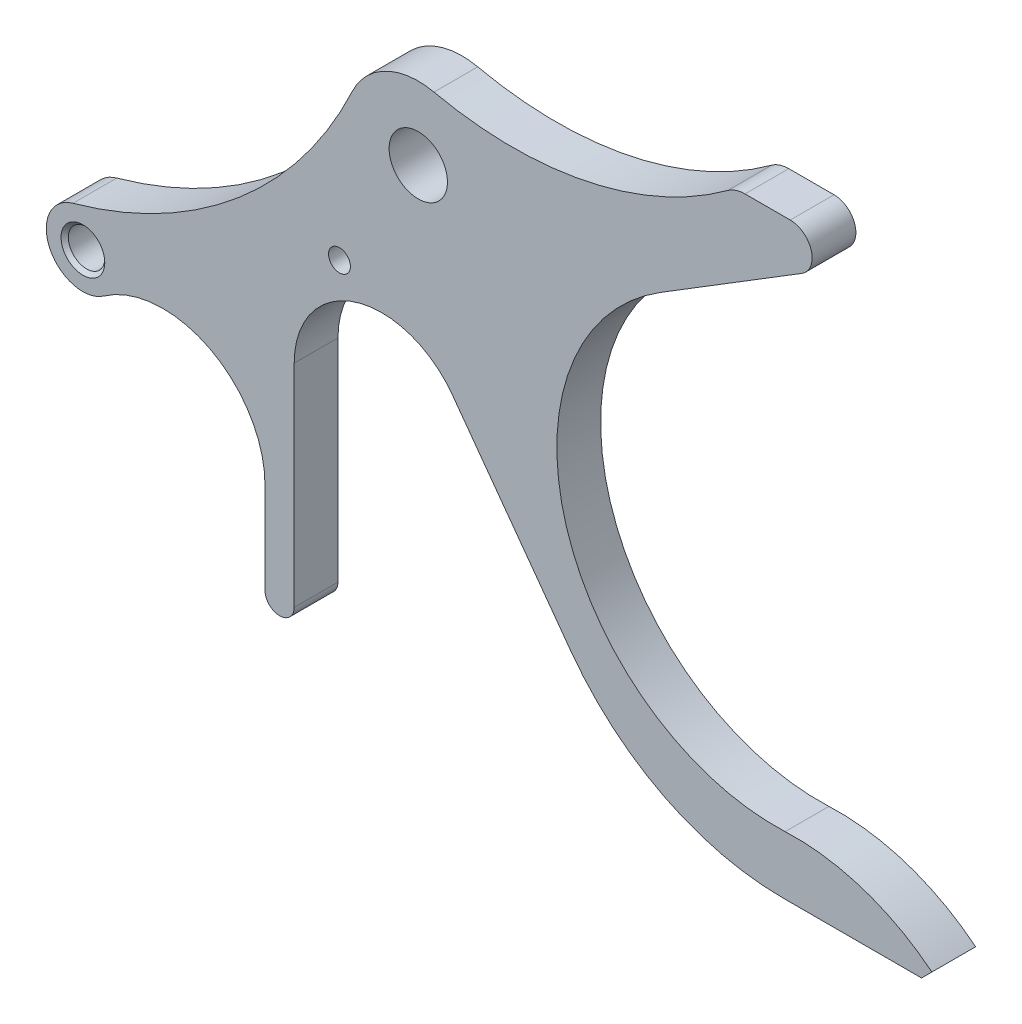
ISO-10303-21;
HEADER;
FILE_DESCRIPTION(('STEP AP214'),'2;1');
FILE_NAME('part.step','',(''),(''),'','','');
FILE_SCHEMA(('AUTOMOTIVE_DESIGN { 1 0 10303 214 1 1 1 1 }'));
ENDSEC;
DATA;
#1=APPLICATION_CONTEXT('core data for automotive mechanical design processes');
#2=APPLICATION_PROTOCOL_DEFINITION('international standard','automotive_design',2000,#1);
#3=PRODUCT_CONTEXT('',#1,'mechanical');
#4=PRODUCT('Part','Part','',(#3));
#5=PRODUCT_RELATED_PRODUCT_CATEGORY('part','',(#4));
#6=PRODUCT_DEFINITION_FORMATION('','',#4);
#7=PRODUCT_DEFINITION_CONTEXT('part definition',#1,'design');
#8=PRODUCT_DEFINITION('design','',#6,#7);
#9=PRODUCT_DEFINITION_SHAPE('','',#8);
#10=(LENGTH_UNIT() NAMED_UNIT(*) SI_UNIT(.MILLI.,.METRE.));
#11=(NAMED_UNIT(*) PLANE_ANGLE_UNIT() SI_UNIT($,.RADIAN.));
#12=(NAMED_UNIT(*) SI_UNIT($,.STERADIAN.) SOLID_ANGLE_UNIT());
#13=UNCERTAINTY_MEASURE_WITH_UNIT(LENGTH_MEASURE(1.E-05),#10,'distance_accuracy_value','');
#14=(GEOMETRIC_REPRESENTATION_CONTEXT(3) GLOBAL_UNCERTAINTY_ASSIGNED_CONTEXT((#13)) GLOBAL_UNIT_ASSIGNED_CONTEXT((#10,
#11,#12)) REPRESENTATION_CONTEXT('',''));
#15=CARTESIAN_POINT('',(0.,0.,0.));
#16=DIRECTION('',(0.,0.,1.));
#17=DIRECTION('',(1.,0.,0.));
#18=AXIS2_PLACEMENT_3D('',#15,#16,#17);
#19=CARTESIAN_POINT('',(-17.505684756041,-24.25,3.));
#20=DIRECTION('',(0.,0.,-1.));
#21=DIRECTION('',(-1.,0.,0.));
#22=AXIS2_PLACEMENT_3D('',#19,#20,#21);
#23=CYLINDRICAL_SURFACE('',#22,7.);
#24=CARTESIAN_POINT('',(-17.505684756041,-24.25,0.));
#25=DIRECTION('',(0.,0.,-1.));
#26=DIRECTION('',(1.,0.,0.));
#27=AXIS2_PLACEMENT_3D('',#24,#25,#26);
#28=CIRCLE('',#27,7.);
#29=CARTESIAN_POINT('',(-21.5541275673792,-18.5394736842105,0.));
#30=VERTEX_POINT('',#29);
#31=CARTESIAN_POINT('',(-10.505684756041,-24.25,0.));
#32=VERTEX_POINT('',#31);
#33=EDGE_CURVE('E163',#30,#32,#28,.T.);
#34=ORIENTED_EDGE('',*,*,#33,.T.);
#35=DIRECTION('',(0.,0.,-1.));
#36=VECTOR('',#35,1.);
#37=CARTESIAN_POINT('',(-10.505684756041,-24.25,3.));
#38=LINE('',#37,#36);
#39=CARTESIAN_POINT('',(-10.505684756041,-24.25,3.));
#40=VERTEX_POINT('',#39);
#41=EDGE_CURVE('E11',#40,#32,#38,.T.);
#42=ORIENTED_EDGE('',*,*,#41,.F.);
#43=CARTESIAN_POINT('',(-17.505684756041,-24.25,3.));
#44=DIRECTION('',(0.,0.,-1.));
#45=DIRECTION('',(1.,0.,0.));
#46=AXIS2_PLACEMENT_3D('',#43,#44,#45);
#47=CIRCLE('',#46,7.);
#48=CARTESIAN_POINT('',(-21.5541275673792,-18.5394736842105,3.));
#49=VERTEX_POINT('',#48);
#50=EDGE_CURVE('E217',#49,#40,#47,.T.);
#51=ORIENTED_EDGE('',*,*,#50,.F.);
#52=DIRECTION('',(0.,0.,-1.));
#53=VECTOR('',#52,1.);
#54=CARTESIAN_POINT('',(-21.5541275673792,-18.5394736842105,3.));
#55=LINE('',#54,#53);
#56=EDGE_CURVE('E176',#49,#30,#55,.T.);
#57=ORIENTED_EDGE('',*,*,#56,.T.);
#58=EDGE_LOOP('',(#34,#42,#51,#57));
#59=FACE_BOUND('',#58,.T.);
#60=ADVANCED_FACE('F27',(#59),#23,.F.);
#61=CARTESIAN_POINT('',(-10.505684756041,-24.25,3.));
#62=DIRECTION('',(1.,0.,0.));
#63=DIRECTION('',(0.,1.,0.));
#64=AXIS2_PLACEMENT_3D('',#61,#62,#63);
#65=PLANE('',#64);
#66=DIRECTION('',(0.,-1.,0.));
#67=VECTOR('',#66,1.);
#68=CARTESIAN_POINT('',(-10.505684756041,-24.25,0.));
#69=LINE('',#68,#67);
#70=CARTESIAN_POINT('',(-10.505684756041,-30.5,0.));
#71=VERTEX_POINT('',#70);
#72=EDGE_CURVE('E159',#32,#71,#69,.T.);
#73=ORIENTED_EDGE('',*,*,#72,.T.);
#74=DIRECTION('',(0.,0.,-1.));
#75=VECTOR('',#74,1.);
#76=CARTESIAN_POINT('',(-10.505684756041,-30.5,3.));
#77=LINE('',#76,#75);
#78=CARTESIAN_POINT('',(-10.505684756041,-30.5,3.));
#79=VERTEX_POINT('',#78);
#80=EDGE_CURVE('E35',#79,#71,#77,.T.);
#81=ORIENTED_EDGE('',*,*,#80,.F.);
#82=DIRECTION('',(0.,-1.,0.));
#83=VECTOR('',#82,1.);
#84=CARTESIAN_POINT('',(-10.505684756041,-24.25,3.));
#85=LINE('',#84,#83);
#86=EDGE_CURVE('E172',#40,#79,#85,.T.);
#87=ORIENTED_EDGE('',*,*,#86,.F.);
#88=ORIENTED_EDGE('',*,*,#41,.T.);
#89=EDGE_LOOP('',(#73,#81,#87,#88));
#90=FACE_BOUND('',#89,.T.);
#91=ADVANCED_FACE('F171',(#90),#65,.F.);
#92=CARTESIAN_POINT('',(-9.50568475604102,-30.5,3.));
#93=DIRECTION('',(0.,0.,-1.));
#94=DIRECTION('',(-1.,0.,0.));
#95=AXIS2_PLACEMENT_3D('',#92,#93,#94);
#96=CYLINDRICAL_SURFACE('',#95,0.999999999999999);
#97=CARTESIAN_POINT('',(-9.50568475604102,-30.5,0.));
#98=DIRECTION('',(0.,0.,1.));
#99=DIRECTION('',(1.,0.,0.));
#100=AXIS2_PLACEMENT_3D('',#97,#98,#99);
#101=CIRCLE('',#100,0.999999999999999);
#102=CARTESIAN_POINT('',(-8.50568475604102,-30.5,0.));
#103=VERTEX_POINT('',#102);
#104=EDGE_CURVE('E165',#71,#103,#101,.T.);
#105=ORIENTED_EDGE('',*,*,#104,.T.);
#106=DIRECTION('',(0.,0.,-1.));
#107=VECTOR('',#106,1.);
#108=CARTESIAN_POINT('',(-8.50568475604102,-30.5,3.));
#109=LINE('',#108,#107);
#110=CARTESIAN_POINT('',(-8.50568475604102,-30.5,3.));
#111=VERTEX_POINT('',#110);
#112=EDGE_CURVE('E298',#111,#103,#109,.T.);
#113=ORIENTED_EDGE('',*,*,#112,.F.);
#114=CARTESIAN_POINT('',(-9.50568475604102,-30.5,3.));
#115=DIRECTION('',(0.,0.,1.));
#116=DIRECTION('',(1.,0.,0.));
#117=AXIS2_PLACEMENT_3D('',#114,#115,#116);
#118=CIRCLE('',#117,0.999999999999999);
#119=EDGE_CURVE('E220',#79,#111,#118,.T.);
#120=ORIENTED_EDGE('',*,*,#119,.F.);
#121=ORIENTED_EDGE('',*,*,#80,.T.);
#122=EDGE_LOOP('',(#105,#113,#120,#121));
#123=FACE_BOUND('',#122,.T.);
#124=ADVANCED_FACE('F339',(#123),#96,.T.);
#125=CARTESIAN_POINT('',(-8.50568475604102,-30.5,3.));
#126=DIRECTION('',(-1.,0.,0.));
#127=DIRECTION('',(0.,0.,1.));
#128=AXIS2_PLACEMENT_3D('',#125,#126,#127);
#129=PLANE('',#128);
#130=DIRECTION('',(0.,1.,0.));
#131=VECTOR('',#130,1.);
#132=CARTESIAN_POINT('',(-8.50568475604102,-30.5,0.));
#133=LINE('',#132,#131);
#134=CARTESIAN_POINT('',(-8.50568475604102,-16.,0.));
#135=VERTEX_POINT('',#134);
#136=EDGE_CURVE('E185',#103,#135,#133,.T.);
#137=ORIENTED_EDGE('',*,*,#136,.T.);
#138=DIRECTION('',(0.,0.,-1.));
#139=VECTOR('',#138,1.);
#140=CARTESIAN_POINT('',(-8.50568475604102,-16.,3.));
#141=LINE('',#140,#139);
#142=CARTESIAN_POINT('',(-8.50568475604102,-16.,3.));
#143=VERTEX_POINT('',#142);
#144=EDGE_CURVE('E295',#143,#135,#141,.T.);
#145=ORIENTED_EDGE('',*,*,#144,.F.);
#146=DIRECTION('',(0.,1.,0.));
#147=VECTOR('',#146,1.);
#148=CARTESIAN_POINT('',(-8.50568475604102,-30.5,3.));
#149=LINE('',#148,#147);
#150=EDGE_CURVE('E222',#111,#143,#149,.T.);
#151=ORIENTED_EDGE('',*,*,#150,.F.);
#152=ORIENTED_EDGE('',*,*,#112,.T.);
#153=EDGE_LOOP('',(#137,#145,#151,#152));
#154=FACE_BOUND('',#153,.T.);
#155=ADVANCED_FACE('F343',(#154),#129,.F.);
#156=CARTESIAN_POINT('',(-2.50568475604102,-16.,3.));
#157=DIRECTION('',(0.,0.,-1.));
#158=DIRECTION('',(-1.,0.,0.));
#159=AXIS2_PLACEMENT_3D('',#156,#157,#158);
#160=CYLINDRICAL_SURFACE('',#159,6.);
#161=CARTESIAN_POINT('',(-2.50568475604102,-16.,0.));
#162=DIRECTION('',(0.,0.,-1.));
#163=DIRECTION('',(1.,0.,0.));
#164=AXIS2_PLACEMENT_3D('',#161,#162,#163);
#165=CIRCLE('',#164,6.);
#166=CARTESIAN_POINT('',(2.3443313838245,-12.4676716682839,0.));
#167=VERTEX_POINT('',#166);
#168=EDGE_CURVE('E187',#135,#167,#165,.T.);
#169=ORIENTED_EDGE('',*,*,#168,.T.);
#170=DIRECTION('',(0.,0.,-1.));
#171=VECTOR('',#170,1.);
#172=CARTESIAN_POINT('',(2.3443313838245,-12.4676716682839,3.));
#173=LINE('',#172,#171);
#174=CARTESIAN_POINT('',(2.3443313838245,-12.4676716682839,3.));
#175=VERTEX_POINT('',#174);
#176=EDGE_CURVE('E292',#175,#167,#173,.T.);
#177=ORIENTED_EDGE('',*,*,#176,.F.);
#178=CARTESIAN_POINT('',(-2.50568475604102,-16.,3.));
#179=DIRECTION('',(0.,0.,-1.));
#180=DIRECTION('',(1.,0.,0.));
#181=AXIS2_PLACEMENT_3D('',#178,#179,#180);
#182=CIRCLE('',#181,6.);
#183=EDGE_CURVE('E224',#143,#175,#182,.T.);
#184=ORIENTED_EDGE('',*,*,#183,.F.);
#185=ORIENTED_EDGE('',*,*,#144,.T.);
#186=EDGE_LOOP('',(#169,#177,#184,#185));
#187=FACE_BOUND('',#186,.T.);
#188=ADVANCED_FACE('F349',(#187),#160,.F.);
#189=CARTESIAN_POINT('',(2.3443313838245,-12.4676716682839,3.));
#190=DIRECTION('',(0.808336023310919,0.588721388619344,0.));
#191=DIRECTION('',(-0.588721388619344,0.808336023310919,0.));
#192=AXIS2_PLACEMENT_3D('',#189,#190,#191);
#193=PLANE('',#192);
#194=DIRECTION('',(0.588721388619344,-0.808336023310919,0.));
#195=VECTOR('',#194,1.);
#196=CARTESIAN_POINT('',(2.3443313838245,-12.4676716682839,0.));
#197=LINE('',#196,#195);
#198=CARTESIAN_POINT('',(10.4499515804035,-23.5969849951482,0.));
#199=VERTEX_POINT('',#198);
#200=EDGE_CURVE('E189',#167,#199,#197,.T.);
#201=ORIENTED_EDGE('',*,*,#200,.T.);
#202=DIRECTION('',(0.,0.,-1.));
#203=VECTOR('',#202,1.);
#204=CARTESIAN_POINT('',(10.4499515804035,-23.5969849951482,3.));
#205=LINE('',#204,#203);
#206=CARTESIAN_POINT('',(10.4499515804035,-23.5969849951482,3.));
#207=VERTEX_POINT('',#206);
#208=EDGE_CURVE('E289',#207,#199,#205,.T.);
#209=ORIENTED_EDGE('',*,*,#208,.F.);
#210=DIRECTION('',(0.588721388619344,-0.808336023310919,0.));
#211=VECTOR('',#210,1.);
#212=CARTESIAN_POINT('',(2.3443313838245,-12.4676716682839,3.));
#213=LINE('',#212,#211);
#214=EDGE_CURVE('E226',#175,#207,#213,.T.);
#215=ORIENTED_EDGE('',*,*,#214,.F.);
#216=ORIENTED_EDGE('',*,*,#176,.T.);
#217=EDGE_LOOP('',(#201,#209,#215,#216));
#218=FACE_BOUND('',#217,.T.);
#219=ADVANCED_FACE('F353',(#218),#193,.F.);
#220=CARTESIAN_POINT('',(25.,-13.,3.));
#221=DIRECTION('',(0.,0.,-1.));
#222=DIRECTION('',(-1.,0.,0.));
#223=AXIS2_PLACEMENT_3D('',#220,#221,#222);
#224=CYLINDRICAL_SURFACE('',#223,18.);
#225=CARTESIAN_POINT('',(25.,-13.,0.));
#226=DIRECTION('',(0.,0.,1.));
#227=DIRECTION('',(1.,0.,0.));
#228=AXIS2_PLACEMENT_3D('',#225,#226,#227);
#229=CIRCLE('',#228,18.);
#230=CARTESIAN_POINT('',(25.,-31.,0.));
#231=VERTEX_POINT('',#230);
#232=EDGE_CURVE('E191',#199,#231,#229,.T.);
#233=ORIENTED_EDGE('',*,*,#232,.T.);
#234=DIRECTION('',(0.,0.,-1.));
#235=VECTOR('',#234,1.);
#236=CARTESIAN_POINT('',(25.,-31.,3.));
#237=LINE('',#236,#235);
#238=CARTESIAN_POINT('',(25.,-31.,3.));
#239=VERTEX_POINT('',#238);
#240=EDGE_CURVE('E286',#239,#231,#237,.T.);
#241=ORIENTED_EDGE('',*,*,#240,.F.);
#242=CARTESIAN_POINT('',(25.,-13.,3.));
#243=DIRECTION('',(0.,0.,1.));
#244=DIRECTION('',(1.,0.,0.));
#245=AXIS2_PLACEMENT_3D('',#242,#243,#244);
#246=CIRCLE('',#245,18.);
#247=EDGE_CURVE('E228',#207,#239,#246,.T.);
#248=ORIENTED_EDGE('',*,*,#247,.F.);
#249=ORIENTED_EDGE('',*,*,#208,.T.);
#250=EDGE_LOOP('',(#233,#241,#248,#249));
#251=FACE_BOUND('',#250,.T.);
#252=ADVANCED_FACE('F357',(#251),#224,.T.);
#253=CARTESIAN_POINT('',(25.,-31.,3.));
#254=DIRECTION('',(0.,1.,0.));
#255=DIRECTION('',(-1.,0.,0.));
#256=AXIS2_PLACEMENT_3D('',#253,#254,#255);
#257=PLANE('',#256);
#258=DIRECTION('',(1.,0.,0.));
#259=VECTOR('',#258,1.);
#260=CARTESIAN_POINT('',(25.,-31.,0.));
#261=LINE('',#260,#259);
#262=CARTESIAN_POINT('',(34.5,-31.,0.));
#263=VERTEX_POINT('',#262);
#264=EDGE_CURVE('E193',#231,#263,#261,.T.);
#265=ORIENTED_EDGE('',*,*,#264,.T.);
#266=DIRECTION('',(0.,0.,-1.));
#267=VECTOR('',#266,1.);
#268=CARTESIAN_POINT('',(34.5,-31.,3.));
#269=LINE('',#268,#267);
#270=CARTESIAN_POINT('',(34.5,-31.,3.));
#271=VERTEX_POINT('',#270);
#272=EDGE_CURVE('E283',#271,#263,#269,.T.);
#273=ORIENTED_EDGE('',*,*,#272,.F.);
#274=DIRECTION('',(1.,0.,0.));
#275=VECTOR('',#274,1.);
#276=CARTESIAN_POINT('',(25.,-31.,3.));
#277=LINE('',#276,#275);
#278=EDGE_CURVE('E230',#239,#271,#277,.T.);
#279=ORIENTED_EDGE('',*,*,#278,.F.);
#280=ORIENTED_EDGE('',*,*,#240,.T.);
#281=EDGE_LOOP('',(#265,#273,#279,#280));
#282=FACE_BOUND('',#281,.T.);
#283=ADVANCED_FACE('F361',(#282),#257,.F.);
#284=CARTESIAN_POINT('',(34.5,-31.,3.));
#285=DIRECTION('',(-0.707106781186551,0.707106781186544,0.));
#286=DIRECTION('',(-0.707106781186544,-0.707106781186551,0.));
#287=AXIS2_PLACEMENT_3D('',#284,#285,#286);
#288=PLANE('',#287);
#289=DIRECTION('',(0.707106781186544,0.707106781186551,0.));
#290=VECTOR('',#289,1.);
#291=CARTESIAN_POINT('',(34.5,-31.,0.));
#292=LINE('',#291,#290);
#293=CARTESIAN_POINT('',(35.2096913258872,-30.2903086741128,0.));
#294=VERTEX_POINT('',#293);
#295=EDGE_CURVE('E195',#263,#294,#292,.T.);
#296=ORIENTED_EDGE('',*,*,#295,.T.);
#297=DIRECTION('',(0.,0.,-1.));
#298=VECTOR('',#297,1.);
#299=CARTESIAN_POINT('',(35.2096913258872,-30.2903086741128,3.));
#300=LINE('',#299,#298);
#301=CARTESIAN_POINT('',(35.2096913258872,-30.2903086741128,3.));
#302=VERTEX_POINT('',#301);
#303=EDGE_CURVE('E280',#302,#294,#300,.T.);
#304=ORIENTED_EDGE('',*,*,#303,.F.);
#305=DIRECTION('',(0.707106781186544,0.707106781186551,0.));
#306=VECTOR('',#305,1.);
#307=CARTESIAN_POINT('',(34.5,-31.,3.));
#308=LINE('',#307,#306);
#309=EDGE_CURVE('E232',#271,#302,#308,.T.);
#310=ORIENTED_EDGE('',*,*,#309,.F.);
#311=ORIENTED_EDGE('',*,*,#272,.T.);
#312=EDGE_LOOP('',(#296,#304,#310,#311));
#313=FACE_BOUND('',#312,.T.);
#314=ADVANCED_FACE('F365',(#313),#288,.F.);
#315=CARTESIAN_POINT('',(25.8,-41.9718200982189,3.));
#316=DIRECTION('',(0.,0.,-1.));
#317=DIRECTION('',(-1.,0.,0.));
#318=AXIS2_PLACEMENT_3D('',#315,#316,#317);
#319=CYLINDRICAL_SURFACE('',#318,15.);
#320=CARTESIAN_POINT('',(25.8,-41.9718200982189,0.));
#321=DIRECTION('',(0.,0.,1.));
#322=DIRECTION('',(1.,0.,0.));
#323=AXIS2_PLACEMENT_3D('',#320,#321,#322);
#324=CIRCLE('',#323,15.);
#325=CARTESIAN_POINT('',(25.15,-26.9859100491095,0.));
#326=VERTEX_POINT('',#325);
#327=EDGE_CURVE('E197',#294,#326,#324,.T.);
#328=ORIENTED_EDGE('',*,*,#327,.T.);
#329=DIRECTION('',(0.,0.,-1.));
#330=VECTOR('',#329,1.);
#331=CARTESIAN_POINT('',(25.15,-26.9859100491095,3.));
#332=LINE('',#331,#330);
#333=CARTESIAN_POINT('',(25.15,-26.9859100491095,3.));
#334=VERTEX_POINT('',#333);
#335=EDGE_CURVE('E277',#334,#326,#332,.T.);
#336=ORIENTED_EDGE('',*,*,#335,.F.);
#337=CARTESIAN_POINT('',(25.8,-41.9718200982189,3.));
#338=DIRECTION('',(0.,0.,1.));
#339=DIRECTION('',(1.,0.,0.));
#340=AXIS2_PLACEMENT_3D('',#337,#338,#339);
#341=CIRCLE('',#340,15.);
#342=EDGE_CURVE('E234',#302,#334,#341,.T.);
#343=ORIENTED_EDGE('',*,*,#342,.F.);
#344=ORIENTED_EDGE('',*,*,#303,.T.);
#345=EDGE_LOOP('',(#328,#336,#343,#344));
#346=FACE_BOUND('',#345,.T.);
#347=ADVANCED_FACE('F369',(#346),#319,.T.);
#348=CARTESIAN_POINT('',(24.5,-12.,3.));
#349=DIRECTION('',(0.,0.,-1.));
#350=DIRECTION('',(-1.,0.,0.));
#351=AXIS2_PLACEMENT_3D('',#348,#349,#350);
#352=CYLINDRICAL_SURFACE('',#351,15.);
#353=CARTESIAN_POINT('',(24.5,-12.,0.));
#354=DIRECTION('',(0.,0.,-1.));
#355=DIRECTION('',(1.,0.,0.));
#356=AXIS2_PLACEMENT_3D('',#353,#354,#355);
#357=CIRCLE('',#356,15.);
#358=CARTESIAN_POINT('',(16.628324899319,0.768583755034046,0.));
#359=VERTEX_POINT('',#358);
#360=EDGE_CURVE('E199',#326,#359,#357,.T.);
#361=ORIENTED_EDGE('',*,*,#360,.T.);
#362=DIRECTION('',(0.,0.,-1.));
#363=VECTOR('',#362,1.);
#364=CARTESIAN_POINT('',(16.628324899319,0.768583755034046,3.));
#365=LINE('',#364,#363);
#366=CARTESIAN_POINT('',(16.628324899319,0.768583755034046,3.));
#367=VERTEX_POINT('',#366);
#368=EDGE_CURVE('E274',#367,#359,#365,.T.);
#369=ORIENTED_EDGE('',*,*,#368,.F.);
#370=CARTESIAN_POINT('',(24.5,-12.,3.));
#371=DIRECTION('',(0.,0.,-1.));
#372=DIRECTION('',(1.,0.,0.));
#373=AXIS2_PLACEMENT_3D('',#370,#371,#372);
#374=CIRCLE('',#373,15.);
#375=EDGE_CURVE('E236',#334,#367,#374,.T.);
#376=ORIENTED_EDGE('',*,*,#375,.F.);
#377=ORIENTED_EDGE('',*,*,#335,.T.);
#378=EDGE_LOOP('',(#361,#369,#376,#377));
#379=FACE_BOUND('',#378,.T.);
#380=ADVANCED_FACE('F373',(#379),#352,.F.);
#381=CARTESIAN_POINT('',(16.628324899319,0.768583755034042,3.));
#382=DIRECTION('',(-0.524778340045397,0.85123891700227,0.));
#383=DIRECTION('',(-0.85123891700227,-0.524778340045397,0.));
#384=AXIS2_PLACEMENT_3D('',#381,#382,#383);
#385=PLANE('',#384);
#386=DIRECTION('',(0.85123891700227,0.524778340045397,0.));
#387=VECTOR('',#386,1.);
#388=CARTESIAN_POINT('',(16.628324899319,0.768583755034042,0.));
#389=LINE('',#388,#387);
#390=CARTESIAN_POINT('',(26.2871675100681,6.72314162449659,0.));
#391=VERTEX_POINT('',#390);
#392=EDGE_CURVE('E201',#359,#391,#389,.T.);
#393=ORIENTED_EDGE('',*,*,#392,.T.);
#394=DIRECTION('',(0.,0.,-1.));
#395=VECTOR('',#394,1.);
#396=CARTESIAN_POINT('',(26.2871675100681,6.72314162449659,3.));
#397=LINE('',#396,#395);
#398=CARTESIAN_POINT('',(26.2871675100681,6.72314162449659,3.));
#399=VERTEX_POINT('',#398);
#400=EDGE_CURVE('E271',#399,#391,#397,.T.);
#401=ORIENTED_EDGE('',*,*,#400,.F.);
#402=DIRECTION('',(0.85123891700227,0.524778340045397,0.));
#403=VECTOR('',#402,1.);
#404=CARTESIAN_POINT('',(16.628324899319,0.768583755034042,3.));
#405=LINE('',#404,#403);
#406=EDGE_CURVE('E238',#367,#399,#405,.T.);
#407=ORIENTED_EDGE('',*,*,#406,.F.);
#408=ORIENTED_EDGE('',*,*,#368,.T.);
#409=EDGE_LOOP('',(#393,#401,#407,#408));
#410=FACE_BOUND('',#409,.T.);
#411=ADVANCED_FACE('F377',(#410),#385,.F.);
#412=CARTESIAN_POINT('',(25.5,8.,3.));
#413=DIRECTION('',(0.,0.,-1.));
#414=DIRECTION('',(-1.,0.,0.));
#415=AXIS2_PLACEMENT_3D('',#412,#413,#414);
#416=CYLINDRICAL_SURFACE('',#415,1.5);
#417=CARTESIAN_POINT('',(25.5,8.,0.));
#418=DIRECTION('',(0.,0.,1.));
#419=DIRECTION('',(1.,0.,0.));
#420=AXIS2_PLACEMENT_3D('',#417,#418,#419);
#421=CIRCLE('',#420,1.5);
#422=CARTESIAN_POINT('',(25.5,9.50000000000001,0.));
#423=VERTEX_POINT('',#422);
#424=EDGE_CURVE('E203',#391,#423,#421,.T.);
#425=ORIENTED_EDGE('',*,*,#424,.T.);
#426=DIRECTION('',(0.,0.,-1.));
#427=VECTOR('',#426,1.);
#428=CARTESIAN_POINT('',(25.5,9.50000000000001,3.));
#429=LINE('',#428,#427);
#430=CARTESIAN_POINT('',(25.5,9.50000000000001,3.));
#431=VERTEX_POINT('',#430);
#432=EDGE_CURVE('E268',#431,#423,#429,.T.);
#433=ORIENTED_EDGE('',*,*,#432,.F.);
#434=CARTESIAN_POINT('',(25.5,8.,3.));
#435=DIRECTION('',(0.,0.,1.));
#436=DIRECTION('',(1.,0.,0.));
#437=AXIS2_PLACEMENT_3D('',#434,#435,#436);
#438=CIRCLE('',#437,1.5);
#439=EDGE_CURVE('E240',#399,#431,#438,.T.);
#440=ORIENTED_EDGE('',*,*,#439,.F.);
#441=ORIENTED_EDGE('',*,*,#400,.T.);
#442=EDGE_LOOP('',(#425,#433,#440,#441));
#443=FACE_BOUND('',#442,.T.);
#444=ADVANCED_FACE('F381',(#443),#416,.T.);
#445=CARTESIAN_POINT('',(22.4,9.5,3.));
#446=DIRECTION('',(0.,-1.,0.));
#447=DIRECTION('',(1.,0.,0.));
#448=AXIS2_PLACEMENT_3D('',#445,#446,#447);
#449=PLANE('',#448);
#450=DIRECTION('',(-1.,0.,0.));
#451=VECTOR('',#450,1.);
#452=CARTESIAN_POINT('',(22.4,9.5,0.));
#453=LINE('',#452,#451);
#454=CARTESIAN_POINT('',(22.4,9.5,0.));
#455=VERTEX_POINT('',#454);
#456=EDGE_CURVE('E205',#423,#455,#453,.T.);
#457=ORIENTED_EDGE('',*,*,#456,.T.);
#458=DIRECTION('',(0.,0.,-1.));
#459=VECTOR('',#458,1.);
#460=CARTESIAN_POINT('',(22.4,9.5,3.));
#461=LINE('',#460,#459);
#462=CARTESIAN_POINT('',(22.4,9.5,3.));
#463=VERTEX_POINT('',#462);
#464=EDGE_CURVE('E265',#463,#455,#461,.T.);
#465=ORIENTED_EDGE('',*,*,#464,.F.);
#466=DIRECTION('',(-1.,0.,0.));
#467=VECTOR('',#466,1.);
#468=CARTESIAN_POINT('',(22.4,9.5,3.));
#469=LINE('',#468,#467);
#470=EDGE_CURVE('E242',#431,#463,#469,.T.);
#471=ORIENTED_EDGE('',*,*,#470,.F.);
#472=ORIENTED_EDGE('',*,*,#432,.T.);
#473=EDGE_LOOP('',(#457,#465,#471,#472));
#474=FACE_BOUND('',#473,.T.);
#475=ADVANCED_FACE('F385',(#474),#449,.F.);
#476=CARTESIAN_POINT('',(22.4,7.5,3.));
#477=DIRECTION('',(0.,0.,-1.));
#478=DIRECTION('',(-1.,0.,0.));
#479=AXIS2_PLACEMENT_3D('',#476,#477,#478);
#480=CYLINDRICAL_SURFACE('',#479,2.);
#481=CARTESIAN_POINT('',(22.4,7.5,0.));
#482=DIRECTION('',(0.,0.,1.));
#483=DIRECTION('',(1.,0.,0.));
#484=AXIS2_PLACEMENT_3D('',#481,#482,#483);
#485=CIRCLE('',#484,2.);
#486=CARTESIAN_POINT('',(21.2195426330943,9.11447217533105,0.));
#487=VERTEX_POINT('',#486);
#488=EDGE_CURVE('E207',#455,#487,#485,.T.);
#489=ORIENTED_EDGE('',*,*,#488,.T.);
#490=DIRECTION('',(0.,0.,-1.));
#491=VECTOR('',#490,1.);
#492=CARTESIAN_POINT('',(21.2195426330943,9.11447217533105,3.));
#493=LINE('',#492,#491);
#494=CARTESIAN_POINT('',(21.2195426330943,9.11447217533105,3.));
#495=VERTEX_POINT('',#494);
#496=EDGE_CURVE('E262',#495,#487,#493,.T.);
#497=ORIENTED_EDGE('',*,*,#496,.F.);
#498=CARTESIAN_POINT('',(22.4,7.5,3.));
#499=DIRECTION('',(0.,0.,1.));
#500=DIRECTION('',(1.,0.,0.));
#501=AXIS2_PLACEMENT_3D('',#498,#499,#500);
#502=CIRCLE('',#501,2.);
#503=EDGE_CURVE('E244',#463,#495,#502,.T.);
#504=ORIENTED_EDGE('',*,*,#503,.F.);
#505=ORIENTED_EDGE('',*,*,#464,.T.);
#506=EDGE_LOOP('',(#489,#497,#504,#505));
#507=FACE_BOUND('',#506,.T.);
#508=ADVANCED_FACE('F389',(#507),#480,.T.);
#509=CARTESIAN_POINT('',(6.46382554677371,29.2953743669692,3.));
#510=DIRECTION('',(0.,0.,-1.));
#511=DIRECTION('',(-1.,0.,0.));
#512=AXIS2_PLACEMENT_3D('',#509,#510,#511);
#513=CYLINDRICAL_SURFACE('',#512,25.);
#514=CARTESIAN_POINT('',(6.46382554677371,29.2953743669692,0.));
#515=DIRECTION('',(0.,0.,-1.));
#516=DIRECTION('',(1.,0.,0.));
#517=AXIS2_PLACEMENT_3D('',#514,#515,#516);
#518=CIRCLE('',#517,25.);
#519=CARTESIAN_POINT('',(1.07730425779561,4.88256239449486,0.));
#520=VERTEX_POINT('',#519);
#521=EDGE_CURVE('E209',#487,#520,#518,.T.);
#522=ORIENTED_EDGE('',*,*,#521,.T.);
#523=DIRECTION('',(0.,0.,-1.));
#524=VECTOR('',#523,1.);
#525=CARTESIAN_POINT('',(1.07730425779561,4.88256239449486,3.));
#526=LINE('',#525,#524);
#527=CARTESIAN_POINT('',(1.07730425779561,4.88256239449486,3.));
#528=VERTEX_POINT('',#527);
#529=EDGE_CURVE('E259',#528,#520,#526,.T.);
#530=ORIENTED_EDGE('',*,*,#529,.F.);
#531=CARTESIAN_POINT('',(6.46382554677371,29.2953743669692,3.));
#532=DIRECTION('',(0.,0.,-1.));
#533=DIRECTION('',(1.,0.,0.));
#534=AXIS2_PLACEMENT_3D('',#531,#532,#533);
#535=CIRCLE('',#534,25.);
#536=EDGE_CURVE('E246',#495,#528,#535,.T.);
#537=ORIENTED_EDGE('',*,*,#536,.F.);
#538=ORIENTED_EDGE('',*,*,#496,.T.);
#539=EDGE_LOOP('',(#522,#530,#537,#538));
#540=FACE_BOUND('',#539,.T.);
#541=ADVANCED_FACE('F393',(#540),#513,.F.);
#542=CARTESIAN_POINT('',(0.,0.,3.));
#543=DIRECTION('',(0.,0.,-1.));
#544=DIRECTION('',(-1.,0.,0.));
#545=AXIS2_PLACEMENT_3D('',#542,#543,#544);
#546=CYLINDRICAL_SURFACE('',#545,5.);
#547=CARTESIAN_POINT('',(0.,0.,0.));
#548=DIRECTION('',(0.,0.,1.));
#549=DIRECTION('',(1.,0.,0.));
#550=AXIS2_PLACEMENT_3D('',#547,#548,#549);
#551=CIRCLE('',#550,5.);
#552=CARTESIAN_POINT('',(-4.53027644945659,2.11579660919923,0.));
#553=VERTEX_POINT('',#552);
#554=EDGE_CURVE('E211',#520,#553,#551,.T.);
#555=ORIENTED_EDGE('',*,*,#554,.T.);
#556=DIRECTION('',(0.,0.,-1.));
#557=VECTOR('',#556,1.);
#558=CARTESIAN_POINT('',(-4.53027644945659,2.11579660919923,3.));
#559=LINE('',#558,#557);
#560=CARTESIAN_POINT('',(-4.53027644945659,2.11579660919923,3.));
#561=VERTEX_POINT('',#560);
#562=EDGE_CURVE('E256',#561,#553,#559,.T.);
#563=ORIENTED_EDGE('',*,*,#562,.F.);
#564=CARTESIAN_POINT('',(0.,0.,3.));
#565=DIRECTION('',(0.,0.,1.));
#566=DIRECTION('',(1.,0.,0.));
#567=AXIS2_PLACEMENT_3D('',#564,#565,#566);
#568=CIRCLE('',#567,5.);
#569=EDGE_CURVE('E248',#528,#561,#568,.T.);
#570=ORIENTED_EDGE('',*,*,#569,.F.);
#571=ORIENTED_EDGE('',*,*,#529,.T.);
#572=EDGE_LOOP('',(#555,#563,#570,#571));
#573=FACE_BOUND('',#572,.T.);
#574=ADVANCED_FACE('F397',(#573),#546,.T.);
#575=CARTESIAN_POINT('',(-31.7119351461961,14.8105762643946,3.));
#576=DIRECTION('',(0.,0.,-1.));
#577=DIRECTION('',(-1.,0.,0.));
#578=AXIS2_PLACEMENT_3D('',#575,#576,#577);
#579=CYLINDRICAL_SURFACE('',#578,30.);
#580=CARTESIAN_POINT('',(-31.7119351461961,14.8105762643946,0.));
#581=DIRECTION('',(0.,0.,-1.));
#582=DIRECTION('',(1.,0.,0.));
#583=AXIS2_PLACEMENT_3D('',#580,#581,#582);
#584=CIRCLE('',#583,30.);
#585=CARTESIAN_POINT('',(-23.6701488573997,-14.0914941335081,0.));
#586=VERTEX_POINT('',#585);
#587=EDGE_CURVE('E213',#553,#586,#584,.T.);
#588=ORIENTED_EDGE('',*,*,#587,.T.);
#589=DIRECTION('',(0.,0.,-1.));
#590=VECTOR('',#589,1.);
#591=CARTESIAN_POINT('',(-23.6701488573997,-14.0914941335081,3.));
#592=LINE('',#591,#590);
#593=CARTESIAN_POINT('',(-23.6701488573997,-14.0914941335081,3.));
#594=VERTEX_POINT('',#593);
#595=EDGE_CURVE('E253',#594,#586,#592,.T.);
#596=ORIENTED_EDGE('',*,*,#595,.F.);
#597=CARTESIAN_POINT('',(-31.7119351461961,14.8105762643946,3.));
#598=DIRECTION('',(0.,0.,-1.));
#599=DIRECTION('',(1.,0.,0.));
#600=AXIS2_PLACEMENT_3D('',#597,#598,#599);
#601=CIRCLE('',#600,30.);
#602=EDGE_CURVE('E48',#561,#594,#601,.T.);
#603=ORIENTED_EDGE('',*,*,#602,.F.);
#604=ORIENTED_EDGE('',*,*,#562,.T.);
#605=EDGE_LOOP('',(#588,#596,#603,#604));
#606=FACE_BOUND('',#605,.T.);
#607=ADVANCED_FACE('F401',(#606),#579,.F.);
#608=CARTESIAN_POINT('',(-23.,-16.5,3.));
#609=DIRECTION('',(0.,0.,-1.));
#610=DIRECTION('',(-1.,0.,0.));
#611=AXIS2_PLACEMENT_3D('',#608,#609,#610);
#612=CYLINDRICAL_SURFACE('',#611,2.5);
#613=CARTESIAN_POINT('',(-23.,-16.5,0.));
#614=DIRECTION('',(0.,0.,1.));
#615=DIRECTION('',(1.,0.,0.));
#616=AXIS2_PLACEMENT_3D('',#613,#614,#615);
#617=CIRCLE('',#616,2.5);
#618=EDGE_CURVE('E215',#586,#30,#617,.T.);
#619=ORIENTED_EDGE('',*,*,#618,.T.);
#620=ORIENTED_EDGE('',*,*,#56,.F.);
#621=CARTESIAN_POINT('',(-23.,-16.5,3.));
#622=DIRECTION('',(0.,0.,1.));
#623=DIRECTION('',(1.,0.,0.));
#624=AXIS2_PLACEMENT_3D('',#621,#622,#623);
#625=CIRCLE('',#624,2.5);
#626=EDGE_CURVE('E43',#594,#49,#625,.T.);
#627=ORIENTED_EDGE('',*,*,#626,.F.);
#628=ORIENTED_EDGE('',*,*,#595,.T.);
#629=EDGE_LOOP('',(#619,#620,#627,#628));
#630=FACE_BOUND('',#629,.T.);
#631=ADVANCED_FACE('F405',(#630),#612,.T.);
#632=CARTESIAN_POINT('',(-17.505684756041,-24.25,3.));
#633=DIRECTION('',(0.,0.,1.));
#634=DIRECTION('',(1.,0.,0.));
#635=AXIS2_PLACEMENT_3D('',#632,#633,#634);
#636=PLANE('',#635);
#637=CARTESIAN_POINT('',(-5.4,-8.34,3.));
#638=DIRECTION('',(0.,0.,1.));
#639=DIRECTION('',(1.,0.,0.));
#640=AXIS2_PLACEMENT_3D('',#637,#638,#639);
#641=CIRCLE('',#640,0.75);
#642=CARTESIAN_POINT('',(-4.65,-8.34,3.));
#643=VERTEX_POINT('',#642);
#644=EDGE_CURVE('E315',#643,#643,#641,.T.);
#645=ORIENTED_EDGE('',*,*,#644,.F.);
#646=EDGE_LOOP('',(#645));
#647=FACE_BOUND('',#646,.T.);
#648=CARTESIAN_POINT('',(-22.9900386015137,-16.5232223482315,3.));
#649=DIRECTION('',(0.,0.,1.));
#650=DIRECTION('',(1.,0.,0.));
#651=AXIS2_PLACEMENT_3D('',#648,#649,#650);
#652=CIRCLE('',#651,1.5);
#653=CARTESIAN_POINT('',(-21.4900386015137,-16.5232223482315,3.));
#654=VERTEX_POINT('',#653);
#655=EDGE_CURVE('E303',#654,#654,#652,.T.);
#656=ORIENTED_EDGE('',*,*,#655,.F.);
#657=EDGE_LOOP('',(#656));
#658=FACE_BOUND('',#657,.T.);
#659=CARTESIAN_POINT('',(0.,0.,3.));
#660=DIRECTION('',(0.,0.,1.));
#661=DIRECTION('',(1.,0.,0.));
#662=AXIS2_PLACEMENT_3D('',#659,#660,#661);
#663=CIRCLE('',#662,2.);
#664=CARTESIAN_POINT('',(2.,0.,3.));
#665=VERTEX_POINT('',#664);
#666=EDGE_CURVE('E180',#665,#665,#663,.T.);
#667=ORIENTED_EDGE('',*,*,#666,.F.);
#668=EDGE_LOOP('',(#667));
#669=FACE_BOUND('',#668,.T.);
#670=ORIENTED_EDGE('',*,*,#50,.T.);
#671=ORIENTED_EDGE('',*,*,#86,.T.);
#672=ORIENTED_EDGE('',*,*,#119,.T.);
#673=ORIENTED_EDGE('',*,*,#150,.T.);
#674=ORIENTED_EDGE('',*,*,#183,.T.);
#675=ORIENTED_EDGE('',*,*,#214,.T.);
#676=ORIENTED_EDGE('',*,*,#247,.T.);
#677=ORIENTED_EDGE('',*,*,#278,.T.);
#678=ORIENTED_EDGE('',*,*,#309,.T.);
#679=ORIENTED_EDGE('',*,*,#342,.T.);
#680=ORIENTED_EDGE('',*,*,#375,.T.);
#681=ORIENTED_EDGE('',*,*,#406,.T.);
#682=ORIENTED_EDGE('',*,*,#439,.T.);
#683=ORIENTED_EDGE('',*,*,#470,.T.);
#684=ORIENTED_EDGE('',*,*,#503,.T.);
#685=ORIENTED_EDGE('',*,*,#536,.T.);
#686=ORIENTED_EDGE('',*,*,#569,.T.);
#687=ORIENTED_EDGE('',*,*,#602,.T.);
#688=ORIENTED_EDGE('',*,*,#626,.T.);
#689=EDGE_LOOP('',(#670,#671,#672,#673,#674,#675,#676,#677,#678,#679,#680,#681,#682,#683,#684,
#685,#686,#687,#688));
#690=FACE_BOUND('',#689,.T.);
#691=ADVANCED_FACE('F409',(#647,#658,#669,#690),#636,.T.);
#692=CARTESIAN_POINT('',(-17.505684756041,-24.25,0.));
#693=DIRECTION('',(0.,0.,1.));
#694=DIRECTION('',(1.,0.,0.));
#695=AXIS2_PLACEMENT_3D('',#692,#693,#694);
#696=PLANE('',#695);
#697=CARTESIAN_POINT('',(-5.4,-8.34,0.));
#698=DIRECTION('',(0.,0.,1.));
#699=DIRECTION('',(1.,0.,0.));
#700=AXIS2_PLACEMENT_3D('',#697,#698,#699);
#701=CIRCLE('',#700,0.75);
#702=CARTESIAN_POINT('',(-4.65,-8.34,0.));
#703=VERTEX_POINT('',#702);
#704=EDGE_CURVE('E30',#703,#703,#701,.T.);
#705=ORIENTED_EDGE('',*,*,#704,.T.);
#706=EDGE_LOOP('',(#705));
#707=FACE_BOUND('',#706,.T.);
#708=CARTESIAN_POINT('',(-22.9900386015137,-16.5232223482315,0.));
#709=DIRECTION('',(0.,0.,1.));
#710=DIRECTION('',(1.,0.,0.));
#711=AXIS2_PLACEMENT_3D('',#708,#709,#710);
#712=CIRCLE('',#711,1.24999999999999);
#713=CARTESIAN_POINT('',(-21.7400386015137,-16.5232223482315,0.));
#714=VERTEX_POINT('',#713);
#715=EDGE_CURVE('E301',#714,#714,#712,.T.);
#716=ORIENTED_EDGE('',*,*,#715,.T.);
#717=EDGE_LOOP('',(#716));
#718=FACE_BOUND('',#717,.T.);
#719=CARTESIAN_POINT('',(0.,0.,0.));
#720=DIRECTION('',(0.,0.,1.));
#721=DIRECTION('',(1.,0.,0.));
#722=AXIS2_PLACEMENT_3D('',#719,#720,#721);
#723=CIRCLE('',#722,2.);
#724=CARTESIAN_POINT('',(2.,0.,0.));
#725=VERTEX_POINT('',#724);
#726=EDGE_CURVE('E177',#725,#725,#723,.T.);
#727=ORIENTED_EDGE('',*,*,#726,.T.);
#728=EDGE_LOOP('',(#727));
#729=FACE_BOUND('',#728,.T.);
#730=ORIENTED_EDGE('',*,*,#33,.F.);
#731=ORIENTED_EDGE('',*,*,#618,.F.);
#732=ORIENTED_EDGE('',*,*,#587,.F.);
#733=ORIENTED_EDGE('',*,*,#554,.F.);
#734=ORIENTED_EDGE('',*,*,#521,.F.);
#735=ORIENTED_EDGE('',*,*,#488,.F.);
#736=ORIENTED_EDGE('',*,*,#456,.F.);
#737=ORIENTED_EDGE('',*,*,#424,.F.);
#738=ORIENTED_EDGE('',*,*,#392,.F.);
#739=ORIENTED_EDGE('',*,*,#360,.F.);
#740=ORIENTED_EDGE('',*,*,#327,.F.);
#741=ORIENTED_EDGE('',*,*,#295,.F.);
#742=ORIENTED_EDGE('',*,*,#264,.F.);
#743=ORIENTED_EDGE('',*,*,#232,.F.);
#744=ORIENTED_EDGE('',*,*,#200,.F.);
#745=ORIENTED_EDGE('',*,*,#168,.F.);
#746=ORIENTED_EDGE('',*,*,#136,.F.);
#747=ORIENTED_EDGE('',*,*,#104,.F.);
#748=ORIENTED_EDGE('',*,*,#72,.F.);
#749=EDGE_LOOP('',(#730,#731,#732,#733,#734,#735,#736,#737,#738,#739,#740,#741,#742,#743,#744,
#745,#746,#747,#748));
#750=FACE_BOUND('',#749,.T.);
#751=ADVANCED_FACE('F160',(#707,#718,#729,#750),#696,.F.);
#752=CARTESIAN_POINT('',(0.,0.,0.));
#753=DIRECTION('',(0.,0.,1.));
#754=DIRECTION('',(1.,0.,0.));
#755=AXIS2_PLACEMENT_3D('',#752,#753,#754);
#756=CYLINDRICAL_SURFACE('',#755,2.);
#757=ORIENTED_EDGE('',*,*,#726,.F.);
#758=EDGE_LOOP('',(#757));
#759=FACE_BOUND('',#758,.T.);
#760=ORIENTED_EDGE('',*,*,#666,.T.);
#761=EDGE_LOOP('',(#760));
#762=FACE_BOUND('',#761,.T.);
#763=ADVANCED_FACE('F415',(#759,#762),#756,.F.);
#764=CARTESIAN_POINT('',(-22.9900386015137,-16.5232223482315,3.));
#765=DIRECTION('',(0.,0.,1.));
#766=DIRECTION('',(1.,0.,0.));
#767=AXIS2_PLACEMENT_3D('',#764,#765,#766);
#768=CYLINDRICAL_SURFACE('',#767,1.24999999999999);
#769=CARTESIAN_POINT('',(-22.9900386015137,-16.5232223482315,2.75));
#770=DIRECTION('',(0.,0.,1.));
#771=DIRECTION('',(1.,0.,0.));
#772=AXIS2_PLACEMENT_3D('',#769,#770,#771);
#773=CIRCLE('',#772,1.24999999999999);
#774=CARTESIAN_POINT('',(-21.7400386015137,-16.5232223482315,2.75));
#775=VERTEX_POINT('',#774);
#776=EDGE_CURVE('E308',#775,#775,#773,.T.);
#777=ORIENTED_EDGE('',*,*,#776,.T.);
#778=EDGE_LOOP('',(#777));
#779=FACE_BOUND('',#778,.T.);
#780=ORIENTED_EDGE('',*,*,#715,.F.);
#781=EDGE_LOOP('',(#780));
#782=FACE_BOUND('',#781,.T.);
#783=ADVANCED_FACE('F331',(#779,#782),#768,.F.);
#784=CARTESIAN_POINT('',(-22.9900386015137,-16.5232223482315,3.));
#785=DIRECTION('',(0.,0.,1.));
#786=DIRECTION('',(1.,0.,0.));
#787=AXIS2_PLACEMENT_3D('',#784,#785,#786);
#788=CONICAL_SURFACE('',#787,1.5,0.785398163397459);
#789=ORIENTED_EDGE('',*,*,#776,.F.);
#790=EDGE_LOOP('',(#789));
#791=FACE_BOUND('',#790,.T.);
#792=ORIENTED_EDGE('',*,*,#655,.T.);
#793=EDGE_LOOP('',(#792));
#794=FACE_BOUND('',#793,.T.);
#795=ADVANCED_FACE('F325',(#791,#794),#788,.F.);
#796=CARTESIAN_POINT('',(-5.4,-8.34,-7.));
#797=DIRECTION('',(0.,0.,1.));
#798=DIRECTION('',(1.,0.,0.));
#799=AXIS2_PLACEMENT_3D('',#796,#797,#798);
#800=CYLINDRICAL_SURFACE('',#799,0.75);
#801=ORIENTED_EDGE('',*,*,#644,.T.);
#802=EDGE_LOOP('',(#801));
#803=FACE_BOUND('',#802,.T.);
#804=ORIENTED_EDGE('',*,*,#704,.F.);
#805=EDGE_LOOP('',(#804));
#806=FACE_BOUND('',#805,.T.);
#807=ADVANCED_FACE('F323',(#803,#806),#800,.F.);
#808=CLOSED_SHELL('',(#60,#91,#124,#155,#188,#219,#252,#283,#314,#347,#380,#411,#444,#475,#508,
#541,#574,#607,#631,#691,#751,#763,#783,#795,#807));
#809=MANIFOLD_SOLID_BREP('B2',#808);
#810=ADVANCED_BREP_SHAPE_REPRESENTATION('',(#18,#809),#14);
#811=SHAPE_DEFINITION_REPRESENTATION(#9,#810);
ENDSEC;
END-ISO-10303-21;
